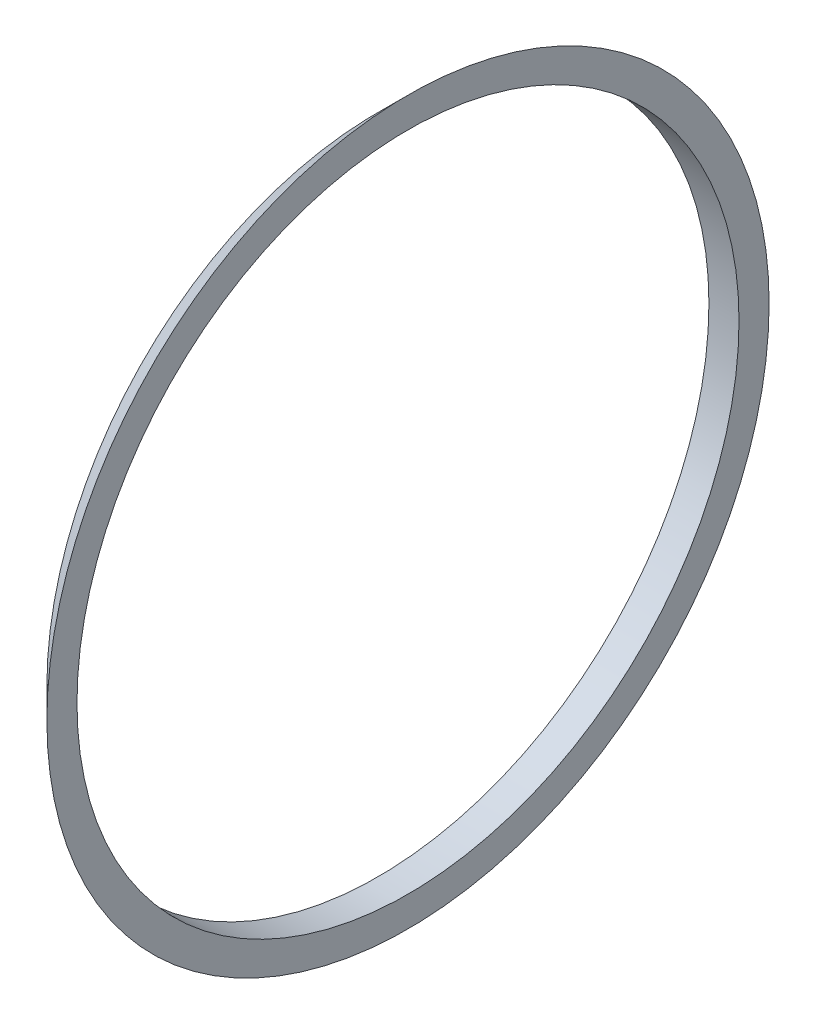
from build123d import *


with BuildPart() as part:
    # Esquisse1 → Base-R_volution (revolve)
    with BuildSketch(Plane.XY, mode=Mode.PRIVATE) as base_r_volution_sk:
        Polygon((-32.19947559, 33), (-29.19947559, 33), (-29.19947559, 36), align=None)
    revolve(base_r_volution_sk.sketch.rotate(Axis((0, 0, 0), (-1, 0, 0)), 90), axis=Axis((0, 0, 0), (-1, 0, 0)))


solid = part.part
